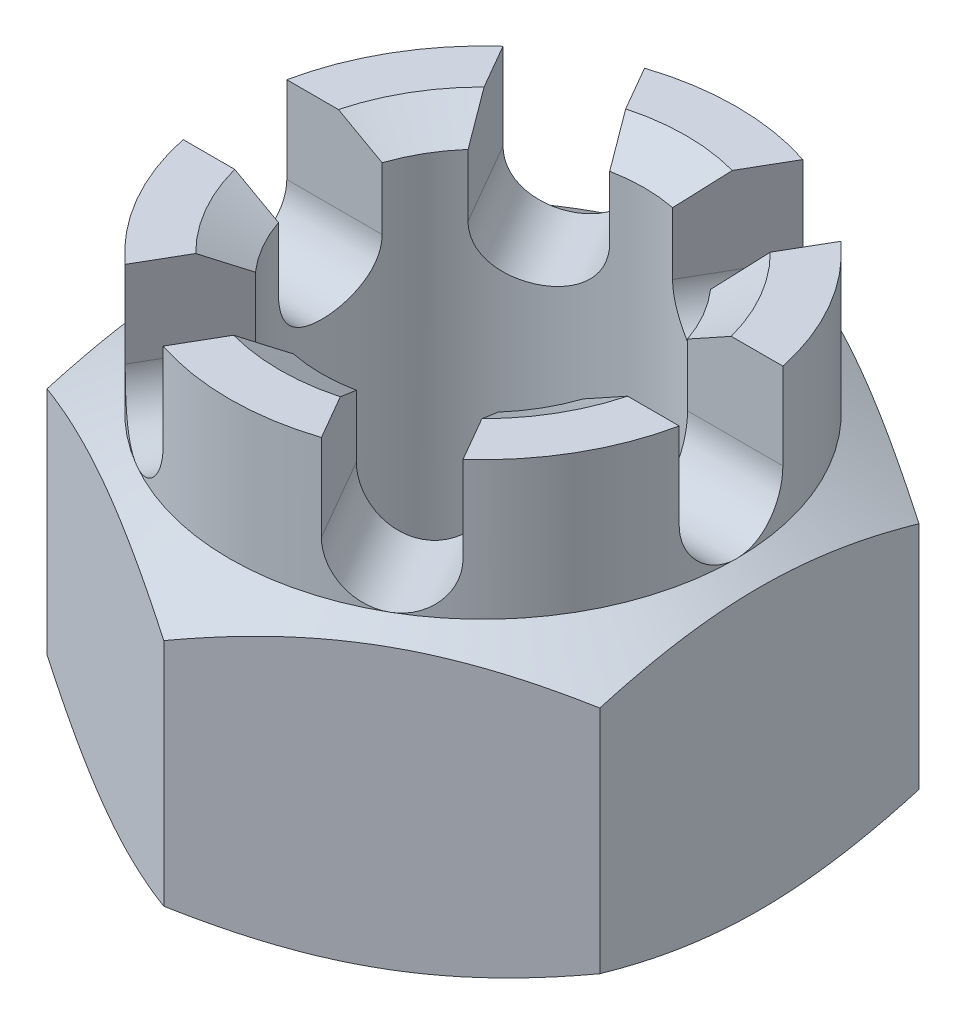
from build123d import *

# Parameters (mm, degrees)
BASENUT_DEPTH    = 19
HOLESKE_R        = 7
TAPPEDHOLE_DEPTH = 27.400757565
CHAMFER1_SIZE    = 1.05
CHAMFER1_SIZE2   = 1.818653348
SLOT_DEPTH       = 28.8
SLOTPAT_COUNT    = 6


with BuildPart() as part:
    # BaseNutSke → BaseNut (new body)
    with BuildSketch(Plane(origin=(0, 0, 0), x_dir=(1, 0, 0), z_dir=(0, 1, 0))):
        Polygon((0, 13.856406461), (-12, 6.92820323), (-12, -6.92820323), (0, -13.856406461), (12, -6.92820323), (12, 6.92820323), align=None)
    extrude(amount=BASENUT_DEPTH)

    # CutNutSke → CutNut (revolve, cut)
    with BuildSketch(Plane(origin=(0, 0, 0), x_dir=(0, 0, -1), z_dir=(1, 0, 0)), mode=Mode.PRIVATE) as cutnut_sk:
        Polygon((-13.856406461, 19), (-11.5, 19), (-13.856406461, 17.639528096), align=None)
    cutnut = revolve(cutnut_sk.sketch.rotate(Axis((0, 0, 0), (0, 1, 0)), 180), axis=Axis((0, 0, 0), (0, 1, 0)), mode=Mode.SUBTRACT)

    # MirrorChamfer: CutNut across plane
    add(cutnut.mirror(Plane.ZX.offset(9.5)), mode=Mode.SUBTRACT)

    # HoleSke → TappedHole (cut, through all)
    with BuildSketch(Plane(origin=(0, 19, 0), x_dir=(1, 0, 0), z_dir=(0, 1, 0))):
        with Locations(Location((0, 0, 0), (0, 0, 270))):
            Circle(HOLESKE_R)
    extrude(amount=-TAPPEDHOLE_DEPTH, mode=Mode.SUBTRACT)

    # Chamfer1
    chamfer1_edges = [part.edges().sort_by_distance(p)[0] for p in [
        (0, 0, -7),
        (0, 19, -7),
    ]]
    chamfer1_side = [part.faces().sort_by_distance(p)[0] for p in [
        (0, 9.5, -7),
    ]]
    chamfer(chamfer1_edges, length=CHAMFER1_SIZE, length2=CHAMFER1_SIZE2, reference=chamfer1_side[0])

    # SlotSke → Slot (cut)
    with BuildSketch(Plane(origin=(0, 0, 0), x_dir=(0, 0, -1), z_dir=(1, 0, 0))):
        with BuildLine():
            Line((-2.25, 32), (2.25, 32))
            Line((2.25, 32), (2.25, 15.25))
            ThreePointArc((2.25, 15.25), (0, 13), (-2.25, 15.25))
            Line((-2.25, 15.25), (-2.25, 32))
        make_face()
    slot = extrude(amount=-SLOT_DEPTH, mode=Mode.SUBTRACT)

    # SlotPat: Slot ×6 about axis
    slotpat_axis = Axis((0, 0, 0), (0, 1, 0))
    for i in range(1, SLOTPAT_COUNT):
        add(slot.rotate(slotpat_axis, i * 360 / SLOTPAT_COUNT), mode=Mode.SUBTRACT)

    # TopCutSke → TopCut (revolve, cut)
    with BuildSketch(Plane(origin=(0, 0, 0), x_dir=(0, 0, -1), z_dir=(1, 0, 0)), mode=Mode.PRIVATE) as topcut_sk:
        Polygon((-11, 32), (-11, 13), (-33.516660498, 0), (-33.516660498, 32), align=None)
    revolve(topcut_sk.sketch.rotate(Axis((0, 0, 0), (0, 1, 0)), 180), axis=Axis((0, 0, 0), (0, 1, 0)), mode=Mode.SUBTRACT)


solid = part.part
